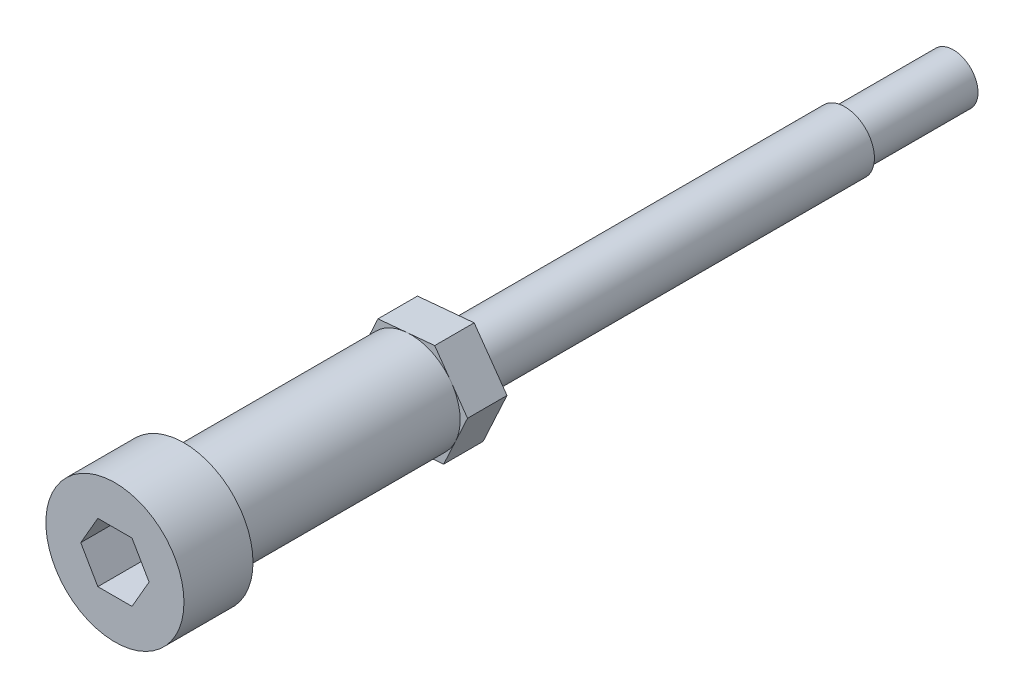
from build123d import *

# Parameters (mm, degrees)
ENL_V_MAT_EXTRU_1_DEPTH = 10
BOSS_EXTRU_1_DEPTH      = 8


with BuildPart() as part:
    # Esquisse2 → Base-R_volution (revolve)
    with BuildSketch(Plane(origin=(0, 0, 0), x_dir=(0, 0, -1), z_dir=(1, 0, 0)), mode=Mode.PRIVATE) as base_r_volution_sk:
        Polygon((0, 0), (0, 14), (14, 14), (14, 10), (60, 10), (60, 6), (148, 6), (148, 5), (170, 5), (170, 0), align=None)
    revolve(base_r_volution_sk.sketch.rotate(Axis((0, 0, 67), (0, 0, -1)), 90), axis=Axis((0, 0, 67), (0, 0, -1)))

    # Esquisse3 → Enl_v. mat.-Extru.1 (cut)
    with BuildSketch(Plane.XY):
        Polygon((6.92820323, 0), (3.464101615, 6), (-3.464101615, 6), (-6.92820323, 0), (-3.464101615, -6), (3.464101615, -6), align=None)
    extrude(amount=-ENL_V_MAT_EXTRU_1_DEPTH, mode=Mode.SUBTRACT)

    # Esquisse7 → Boss.-Extru.1 (add)
    with BuildSketch(Plane(origin=(0, 0, -60), x_dir=(-1, 0, 0), z_dir=(0, 0, -1))):
        Polygon((4.838867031, -10.484211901), (11.499027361, -1.051524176), (6.660160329, 9.432687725), (-4.838867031, 10.484211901), (-11.499027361, 1.051524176), (-6.660160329, -9.432687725), align=None)
    extrude(amount=BOSS_EXTRU_1_DEPTH)


solid = part.part
